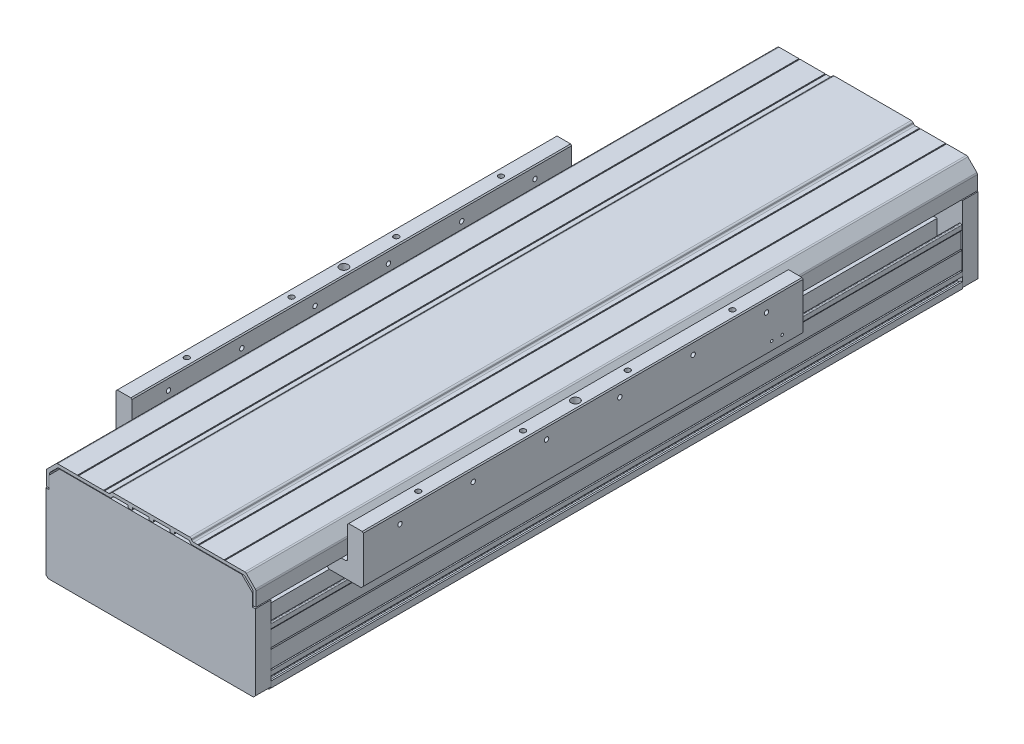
from build123d import *

# Parameters (mm, degrees)
EXTRUDE_1_DEPTH             = 330
EXTRUDE_2_DEPTH             = 15
EXTRUDE_3_DEPTH             = 15
EXTRUDE_4_DEPTH             = 420
EXTRUDE_5_DEPTH             = 344.5
HOLE_WIZARD_M8_1_AT_2_COUNT = 2
HOLE_WIZARD_M8_1_AT_2_PITCH = 173
PATTERN_LINEAR_1_COUNT      = 3
PATTERN_LINEAR_1_PITCH      = 240
HOLE_WIZARD_M6_1_AT_2_COUNT = 2
HOLE_WIZARD_M6_1_AT_2_PITCH = 100
HOLE_WIZARD_M6_1_AT_3_COUNT = 2
HOLE_WIZARD_M6_1_AT_3_PITCH = 200
HOLE_WIZARD_M6_1_AT_4_COUNT = 2
HOLE_WIZARD_M6_1_AT_4_PITCH = 300
HOLE_WIZARD_M5_1_AT_2_COUNT = 2
HOLE_WIZARD_M5_1_AT_2_PITCH = 70
HOLE_WIZARD_M5_1_AT_3_COUNT = 2
HOLE_WIZARD_M5_1_AT_3_PITCH = 210
HOLE_WIZARD_M5_1_AT_4_COUNT = 2
HOLE_WIZARD_M5_1_AT_4_PITCH = 350
HOLE_WIZARD_M5_1_AT_5_COUNT = 2
HOLE_WIZARD_M5_1_AT_5_PITCH = 280
HOLE_WIZARD_M5_1_AT_6_COUNT = 2
HOLE_WIZARD_M5_1_AT_6_PITCH = 140
SKETCH_13_R                 = 2.5
CUT_EXTRUDE_1_DEPTH         = 47
SKETCH_14_R                 = 4
CUT_EXTRUDE_2_DEPTH         = 18
HOLE_WIZARD_M3_1_AT_2_COUNT = 2
HOLE_WIZARD_M3_1_AT_2_PITCH = 10


with BuildPart() as part:
    # Sketch 1 → Extrude 1 (new, symmetric)
    # profile 1 of 3: a face of its own
    with BuildSketch(Plane.XY):
        with BuildLine():
            Line((-99, 33.5), (-99, 48.5))
            Line((-99, 48.5), (-99.5, 49.5))
            Line((-99.5, 49.5), (-99.5, 53.5))
            ThreePointArc((-99.5, 53.5), (-99.207106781, 54.207106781), (-98.5, 54.5))
            Line((-98.5, 54.5), (-98, 54.5))
            ThreePointArc((-98, 54.5), (-97.292893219, 54.207106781), (-97, 53.5))
            Line((-97, 53.5), (-97, 16.5))
            ThreePointArc((-97, 16.5), (-97.146446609, 16.146446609), (-97.5, 16))
            Line((-97.5, 16), (-99, 16))
            ThreePointArc((-99, 16), (-99.353553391, 16.146446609), (-99.5, 16.5))
            Line((-99.5, 16.5), (-99.5, 32.5))
            Line((-99.5, 32.5), (-99, 33.5))
        make_face()
    # profile 2 of 3: a face of its own
    with BuildSketch(Plane.XY):
        with BuildLine():
            Line((99, 33.5), (99, 48.5))
            Line((99, 48.5), (99.5, 49.5))
            Line((99.5, 49.5), (99.5, 53.5))
            ThreePointArc((99.5, 53.5), (99.207106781, 54.207106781), (98.5, 54.5))
            Line((98.5, 54.5), (98, 54.5))
            ThreePointArc((98, 54.5), (97.292893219, 54.207106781), (97, 53.5))
            Line((97, 53.5), (97, 16.5))
            ThreePointArc((97, 16.5), (97.146446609, 16.146446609), (97.5, 16))
            Line((97.5, 16), (99, 16))
            ThreePointArc((99, 16), (99.353553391, 16.146446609), (99.5, 16.5))
            Line((99.5, 16.5), (99.5, 32.5))
            Line((99.5, 32.5), (99, 33.5))
        make_face()
    # profile 3 of 3: a face of its own
    with BuildSketch(Plane.XY):
        with BuildLine():
            Line((-78, 44.5), (-43.5, 44.5))
            Line((-43.5, 44.5), (-43.5, 22.499959))
            ThreePointArc((-43.5, 22.499959), (-42.035533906, 18.964425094), (-38.5, 17.499959))
            Line((-38.5, 17.499959), (-38.5, 16.499959))
            Line((-38.5, 16.499959), (-22.9999959, 16.499959))
            Line((-22.9999959, 16.499959), (-22.5, 15.999959))
            Line((-22.5, 15.999959), (22.5, 15.999959))
            Line((22.5, 15.999959), (22.9999959, 16.499959))
            Line((22.9999959, 16.499959), (38.5, 16.499959))
            Line((38.5, 16.499959), (38.5, 17.499959))
            ThreePointArc((38.5, 17.499959), (42.035533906, 18.964425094), (43.5, 22.499959))
            Line((43.5, 22.499959), (43.5, 44.5))
            Line((43.5, 44.5), (71, 44.5))
            Line((71, 44.5), (71, 47.5))
            Line((71, 47.5), (76, 47.5))
            Line((76, 47.5), (76, 31.4999))
            Line((76, 31.4999), (76.3, 31.4999))
            Line((76.3, 31.4999), (76.3, 24.58099761))
            ThreePointArc((76.3, 24.58099761), (76.246719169, 24.583200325), (76.193631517, 24.588240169))
            ThreePointArc((76.193631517, 24.588240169), (74.617365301, 22.19481599), (77.476923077, 22.384615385))
            ThreePointArc((77.476923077, 22.384615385), (77.845299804, 22.832050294), (78.4, 23))
            Line((78.4, 23), (80.8, 23))
            Line((80.8, 23), (81, 22.8))
            Line((81, 22.8), (81, 21.2))
            Line((81, 21.2), (80.8, 21))
            Line((80.8, 21), (79.5, 21))
            Line((79.5, 21), (79.5, 18))
            Line((79.5, 18), (93.5, 18))
            Line((93.5, 18), (93.5, 21))
            Line((93.5, 21), (92.2, 21))
            Line((92.2, 21), (92, 21.2))
            Line((92, 21.2), (92, 22.8))
            Line((92, 22.8), (92.2, 23))
            Line((92.2, 23), (94, 23))
            ThreePointArc((94, 23), (94.707106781, 23.292893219), (95, 24))
            Line((95, 24), (95, 25.5))
            Line((95, 25.5), (97, 25.5))
            Line((97, 25.5), (97, 22.000000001))
            Line((97, 22.000000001), (96.7, 21.5))
            Line((96.7, 21.5), (97, 21))
            Line((97, 21), (97, 15.5))
            Line((97, 15.5), (100, 15.5))
            Line((100, 15.5), (99.999985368, 11.15))
            Line((99.999985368, 11.15), (98.499985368, 11.15))
            Line((98.499985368, 11.15), (98.499985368, 12.65))
            Line((98.499985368, 12.65), (95.499985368, 12.65))
            ThreePointArc((95.499985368, 12.65), (95.146431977, 12.503553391), (94.999985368, 12.15))
            Line((94.999985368, 12.15), (94.999985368, 5.85))
            ThreePointArc((94.999985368, 5.85), (95.146431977, 5.496446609), (95.499985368, 5.35))
            Line((95.499985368, 5.35), (98.499985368, 5.35))
            Line((98.499985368, 5.35), (98.499985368, 6.85))
            Line((98.499985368, 6.85), (99.999985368, 6.85))
            Line((99.999985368, 6.85), (100, 1))
            Line((100, 1), (98, -1))
            Line((98, -1), (36, -1))
            Line((36, -1), (35, 0))
            Line((35, 0), (-35, 0))
            Line((-35, 0), (-36, -1))
            Line((-36, -1), (-98, -1))
            Line((-98, -1), (-100, 1))
            Line((-100, 1), (-99.999985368, 6.85))
            Line((-99.999985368, 6.85), (-98.499985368, 6.85))
            Line((-98.499985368, 6.85), (-98.499985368, 5.35))
            Line((-98.499985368, 5.35), (-95.499985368, 5.35))
            ThreePointArc((-95.499985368, 5.35), (-95.146431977, 5.496446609), (-94.999985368, 5.85))
            Line((-94.999985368, 5.85), (-94.999985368, 12.15))
            ThreePointArc((-94.999985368, 12.15), (-95.146431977, 12.503553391), (-95.499985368, 12.65))
            Line((-95.499985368, 12.65), (-98.499985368, 12.65))
            Line((-98.499985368, 12.65), (-98.499985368, 11.15))
            Line((-98.499985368, 11.15), (-99.999985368, 11.15))
            Line((-99.999985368, 11.15), (-100, 15.5))
            Line((-100, 15.5), (-97, 15.5))
            Line((-97, 15.5), (-97, 21))
            Line((-97, 21), (-96.7, 21.5))
            Line((-96.7, 21.5), (-97, 22))
            Line((-97, 22), (-97, 25.5))
            Line((-97, 25.5), (-95, 25.5))
            Line((-95, 25.5), (-95, 24))
            ThreePointArc((-95, 24), (-94.707106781, 23.292893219), (-94, 23))
            Line((-94, 23), (-92.2, 23))
            Line((-92.2, 23), (-92, 22.8))
            Line((-92, 22.8), (-92, 21.2))
            Line((-92, 21.2), (-92.2, 21))
            Line((-92.2, 21), (-93.5, 21))
            Line((-93.5, 21), (-93.5, 18))
            Line((-93.5, 18), (-79.5, 18))
            Line((-79.5, 18), (-79.5, 21))
            Line((-79.5, 21), (-80.8, 21))
            Line((-80.8, 21), (-81, 21.2))
            Line((-81, 21.2), (-81, 22.8))
            Line((-81, 22.8), (-80.8, 23))
            Line((-80.8, 23), (-78.4, 23))
            ThreePointArc((-78.4, 23), (-77.845299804, 22.832050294), (-77.476923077, 22.384615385))
            ThreePointArc((-77.476923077, 22.384615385), (-74.617365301, 22.19481599), (-76.193631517, 24.588240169))
            ThreePointArc((-76.193631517, 24.588240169), (-76.76123201, 24.686146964), (-77.180676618, 25.080890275))
            Line((-77.180676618, 25.080890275), (-78, 26.5))
            Line((-78, 26.5), (-78, 36.5))
            Line((-78, 36.5), (-77.7, 37))
            Line((-77.7, 37), (-78, 37.5))
            Line((-78, 37.5), (-78, 44.5))
        make_face()
        with BuildLine():
            Line((-66.55, 32.5), (-54.5, 32.5))
            ThreePointArc((-54.5, 32.5), (-53.085786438, 31.914213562), (-52.5, 30.5))
            Line((-52.5, 30.5), (-52.5, 16.25))
            ThreePointArc((-52.5, 16.25), (-52.353553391, 15.896446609), (-52, 15.75))
            Line((-52, 15.75), (-51.407878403, 15.75))
            ThreePointArc((-51.407878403, 15.75), (-51.235654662, 15.780597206), (-51.084509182, 15.868644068))
            ThreePointArc((-51.084509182, 15.868644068), (-47.054594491, 13.850026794), (-51.300978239, 12.338983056))
            ThreePointArc((-51.300978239, 12.338983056), (-51.467890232, 12.457980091), (-51.668524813, 12.5))
            Line((-51.668524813, 12.5), (-67.5, 12.5))
            ThreePointArc((-67.5, 12.5), (-68.914213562, 13.085786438), (-69.5, 14.5))
            Line((-69.5, 14.5), (-69.5, 30.092681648))
            ThreePointArc((-69.5, 30.092681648), (-69.617656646, 30.414882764), (-69.915254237, 30.58544747))
            ThreePointArc((-69.915254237, 30.58544747), (-71.07878547, 34.873482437), (-67.05, 33))
            ThreePointArc((-67.05, 33), (-66.903553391, 32.646446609), (-66.55, 32.5))
        make_face(mode=Mode.SUBTRACT)
        with BuildLine():
            Line((-16.901923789, 9.5), (-14.303847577, 11))
            Line((-14.303847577, 11), (-7.333333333, 11))
            Line((-7.333333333, 11), (-4, 9))
            Line((-4, 9), (4, 9))
            Line((4, 9), (7.333333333, 11))
            Line((7.333333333, 11), (14.303847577, 11))
            Line((14.303847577, 11), (16.901923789, 9.5))
            Line((16.901923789, 9.5), (18.062862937, 9.5))
            ThreePointArc((18.062862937, 9.5), (22.45, 8), (18.062862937, 6.5))
            Line((18.062862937, 6.5), (16.901923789, 6.5))
            Line((16.901923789, 6.5), (14.303847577, 5))
            Line((14.303847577, 5), (-14.303847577, 5))
            Line((-14.303847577, 5), (-16.901923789, 6.5))
            Line((-16.901923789, 6.5), (-18.062862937, 6.5))
            ThreePointArc((-18.062862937, 6.5), (-22.45, 8), (-18.062862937, 9.5))
            Line((-18.062862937, 9.5), (-16.901923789, 9.5))
        make_face(mode=Mode.SUBTRACT)
        with BuildLine():
            Line((66.549999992, 32.500000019), (54.499999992, 32.500000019))
            ThreePointArc((54.499999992, 32.500000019), (53.085786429, 31.914213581), (52.499999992, 30.500000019))
            Line((52.499999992, 30.500000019), (52.499999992, 16.250000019))
            ThreePointArc((52.499999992, 16.250000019), (52.353553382, 15.896446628), (51.999999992, 15.750000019))
            Line((51.999999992, 15.750000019), (51.407878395, 15.750000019))
            ThreePointArc((51.407878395, 15.750000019), (51.235654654, 15.780597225), (51.084509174, 15.868644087))
            ThreePointArc((51.084509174, 15.868644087), (47.054594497, 13.850026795), (51.30097824, 12.338983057))
            ThreePointArc((51.30097824, 12.338983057), (51.467890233, 12.457980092), (51.668524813, 12.5))
            Line((51.668524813, 12.5), (67.5, 12.5))
            ThreePointArc((67.5, 12.5), (68.914213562, 13.085786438), (69.5, 14.5))
            Line((69.5, 14.5), (69.5, 30.092681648))
            ThreePointArc((69.5, 30.092681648), (69.617656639, 30.414882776), (69.915254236, 30.585447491))
            ThreePointArc((69.915254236, 30.585447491), (71.078785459, 34.873482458), (67.049999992, 33.000000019))
            ThreePointArc((67.049999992, 33.000000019), (66.903553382, 32.646446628), (66.549999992, 32.500000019))
        make_face(mode=Mode.SUBTRACT)
    extrude(amount=EXTRUDE_1_DEPTH, both=True)

    # Sketch 7 → Hole Wizard M8 _ _ _ _1 (revolve, cut)
    with BuildSketch(Plane(origin=(-86.5, 18, 240), x_dir=(0, 0, 1), z_dir=(1, 0, 0))):
        Polygon((0, 0), (0, 19), (4.5, 19), (4.5, 9), (7, 9), (7, 0), align=None)
    hole_wizard_m8_1 = revolve(axis=Axis((-86.5, 24.35, 240), (0, -1, 0)), mode=Mode.SUBTRACT)

    # Hole Wizard M8 _ _ _ _1 at 2: Hole Wizard M8 _ _ _ _1 ×2
    with Locations(*[(i * HOLE_WIZARD_M8_1_AT_2_PITCH, 0, 0) for i in range(1, HOLE_WIZARD_M8_1_AT_2_COUNT)]):
        add(hole_wizard_m8_1, mode=Mode.SUBTRACT)

    # Pattern Linear 1: Hole Wizard M8 _ _ _ _1 ×3
    with Locations(*[(0, 0, -i * PATTERN_LINEAR_1_PITCH) for i in range(1, PATTERN_LINEAR_1_COUNT)]):
        add(hole_wizard_m8_1, mode=Mode.SUBTRACT)

    # Pattern Linear 1 copy 1 sketch → Pattern Linear 1 copy 1 (revolve, cut)
    with BuildSketch(Plane(origin=(86.5, 18, 0), x_dir=(0, 0, 1), z_dir=(1, 0, 0))):
        Polygon((0, 0), (0, 19), (4.5, 19), (4.5, 9), (7, 9), (7, 0), align=None)
    revolve(axis=Axis((86.5, 24.35, 0), (0, -1, 0)), mode=Mode.SUBTRACT)

    # Pattern Linear 1 copy 2 sketch → Pattern Linear 1 copy 2 (revolve, cut)
    with BuildSketch(Plane(origin=(86.5, 18, -240), x_dir=(0, 0, 1), z_dir=(1, 0, 0))):
        Polygon((0, 0), (0, 19), (4.5, 19), (4.5, 9), (7, 9), (7, 0), align=None)
    revolve(axis=Axis((86.5, 24.35, -240), (0, -1, 0)), mode=Mode.SUBTRACT)


with BuildPart() as body_2:
    # Sketch 2 → Extrude 2 (new body)
    with BuildSketch(Plane.XY.offset(330)):
        Polygon((97.000014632, 86.000015), (87.000014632, 96.000015), (-86.999985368, 96.000015), (-96.999985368, 86.000015), (-96.999985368, 74), (-99.999985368, 74), (-99.999985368, 2), (-97.999985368, 0), (97.999985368, 0), (100.000014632, 2.000029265), (100.000014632, 74), (97.000014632, 74), align=None)
    extrude(amount=EXTRUDE_2_DEPTH)


with BuildPart() as body_3:
    # Sketch 3 → Extrude 3 (new body)
    with BuildSketch(Plane(origin=(0, 0, -330), x_dir=(-1, 0, 0), z_dir=(0, 0, -1))):
        Polygon((97.000014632, 86.000015), (87.000014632, 96.000015), (-86.999985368, 96.000015), (-96.999985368, 86.000015), (-96.999985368, 74), (-99.999985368, 74), (-99.999985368, 2), (-97.999985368, 0), (97.999985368, 0), (100.000014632, 2.000029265), (100.000014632, 74), (97.000014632, 74), align=None)
    extrude(amount=EXTRUDE_3_DEPTH)


with BuildPart() as body_4:
    # Sketch 4 → Extrude 4 (new body)
    with BuildSketch(Plane.XY.offset(260)):
        with BuildLine():
            ThreePointArc((-103, 74), (-102.414213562, 72.585786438), (-101, 72))
            Line((-101, 72), (-96, 72))
            ThreePointArc((-96, 72), (-94.585786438, 72.585786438), (-94, 74))
            Line((-94, 74), (-94, 77.5))
            ThreePointArc((-94, 77.5), (-91.071067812, 84.571067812), (-84, 87.5))
            Line((-84, 87.5), (-58.5, 87.5))
            Line((-58.5, 87.5), (-56.5, 89.5))
            Line((-56.5, 89.5), (56.5, 89.5))
            Line((56.5, 89.5), (58.5, 87.5))
            Line((58.5, 87.5), (84, 87.5))
            ThreePointArc((84, 87.5), (91.071067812, 84.571067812), (94, 77.5))
            Line((94, 77.5), (94, 74))
            ThreePointArc((94, 74), (94.585786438, 72.585786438), (96, 72))
            Line((96, 72), (101, 72))
            ThreePointArc((101, 72), (102.414213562, 72.585786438), (103, 74))
            Line((103, 74), (103, 103))
            Line((103, 103), (104, 104))
            Line((104, 104), (117, 104))
            Line((117, 104), (118, 103))
            Line((118, 103), (118, 59))
            Line((118, 59), (116, 57))
            Line((116, 57), (85, 57))
            Line((85, 57), (83, 59))
            Line((83, 59), (83, 72.5))
            Line((83, 72.5), (-83, 72.5))
            Line((-83, 72.5), (-83, 59))
            Line((-83, 59), (-85, 57))
            Line((-85, 57), (-116, 57))
            Line((-116, 57), (-118, 59))
            Line((-118, 59), (-118, 103))
            Line((-118, 103), (-117, 104))
            Line((-117, 104), (-104, 104))
            Line((-104, 104), (-103, 103))
            Line((-103, 103), (-103, 74))
        make_face()
    extrude(amount=-EXTRUDE_4_DEPTH)

    # Sketch 9 → Hole Wizard M6 _ _1 (revolve, cut)
    with BuildSketch(Plane(origin=(110.5, 104, 200), x_dir=(0, 0, 1), z_dir=(1, 0, 0))):
        Polygon((0, 0), (0, 24.502151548), (2.5, 23), (2.5, 0), align=None)
    hole_wizard_m6_1 = revolve(axis=Axis((110.5, 110.35, 200), (0, -1, 0)), mode=Mode.SUBTRACT)

    # Hole Wizard M6 _ _1 at 2: Hole Wizard M6 _ _1 ×2
    with Locations(*[(0, 0, -i * HOLE_WIZARD_M6_1_AT_2_PITCH) for i in range(1, HOLE_WIZARD_M6_1_AT_2_COUNT)]):
        add(hole_wizard_m6_1, mode=Mode.SUBTRACT)

    # Hole Wizard M6 _ _1 at 3: Hole Wizard M6 _ _1 ×2
    with Locations(*[(0, 0, -i * HOLE_WIZARD_M6_1_AT_3_PITCH) for i in range(1, HOLE_WIZARD_M6_1_AT_3_COUNT)]):
        add(hole_wizard_m6_1, mode=Mode.SUBTRACT)

    # Hole Wizard M6 _ _1 at 4: Hole Wizard M6 _ _1 ×2
    with Locations(*[(0, 0, -i * HOLE_WIZARD_M6_1_AT_4_PITCH) for i in range(1, HOLE_WIZARD_M6_1_AT_4_COUNT)]):
        add(hole_wizard_m6_1, mode=Mode.SUBTRACT)

    # Sketch 11 → Hole Wizard M5 _ _1 (revolve, cut)
    with BuildSketch(Plane(origin=(118, 93, 225), x_dir=(0, 0, -1), z_dir=(0, 1, 0))):
        Polygon((0, 0), (0, 17.2618073), (2.1, 16), (2.1, 0), align=None)
    hole_wizard_m5_1 = revolve(axis=Axis((124.35, 93, 225), (-1, 0, 0)), mode=Mode.SUBTRACT)

    # Hole Wizard M5 _ _1 at 2: Hole Wizard M5 _ _1 ×2
    with Locations(*[(0, 0, -i * HOLE_WIZARD_M5_1_AT_2_PITCH) for i in range(1, HOLE_WIZARD_M5_1_AT_2_COUNT)]):
        add(hole_wizard_m5_1, mode=Mode.SUBTRACT)

    # Hole Wizard M5 _ _1 at 3: Hole Wizard M5 _ _1 ×2
    with Locations(*[(0, 0, -i * HOLE_WIZARD_M5_1_AT_3_PITCH) for i in range(1, HOLE_WIZARD_M5_1_AT_3_COUNT)]):
        add(hole_wizard_m5_1, mode=Mode.SUBTRACT)

    # Hole Wizard M5 _ _1 at 4: Hole Wizard M5 _ _1 ×2
    with Locations(*[(0, 0, -i * HOLE_WIZARD_M5_1_AT_4_PITCH) for i in range(1, HOLE_WIZARD_M5_1_AT_4_COUNT)]):
        add(hole_wizard_m5_1, mode=Mode.SUBTRACT)

    # Hole Wizard M5 _ _1 at 5: Hole Wizard M5 _ _1 ×2
    with Locations(*[(0, 0, -i * HOLE_WIZARD_M5_1_AT_5_PITCH) for i in range(1, HOLE_WIZARD_M5_1_AT_5_COUNT)]):
        add(hole_wizard_m5_1, mode=Mode.SUBTRACT)

    # Hole Wizard M5 _ _1 at 6: Hole Wizard M5 _ _1 ×2
    with Locations(*[(0, 0, -i * HOLE_WIZARD_M5_1_AT_6_PITCH) for i in range(1, HOLE_WIZARD_M5_1_AT_6_COUNT)]):
        add(hole_wizard_m5_1, mode=Mode.SUBTRACT)

    # Sketch 13 → Cut-Extrude 1 (cut)
    with BuildSketch(Plane(origin=(0, 104, 0), x_dir=(1, 0, 0), z_dir=(0, 1, 0))):
        with Locations(Location((110.5, -50, 0), (0, 0, 270))):
            Circle(SKETCH_13_R)
    cut_extrude_1 = extrude(amount=-CUT_EXTRUDE_1_DEPTH, mode=Mode.SUBTRACT)

    # Sketch 14 → Cut-Extrude 2 (cut)
    with BuildSketch(Plane(origin=(0, 104, 0), x_dir=(1, 0, 0), z_dir=(0, 1, 0))):
        with Locations(Location((110.5, -50, 0), (0, 0, 270))):
            Circle(SKETCH_14_R)
    cut_extrude_2 = extrude(amount=-CUT_EXTRUDE_2_DEPTH, mode=Mode.SUBTRACT)

    # Mirror 1: Hole Wizard M6 _ _1, Hole Wizard M5 _ _1, Cut-Extrude 1, Cut-Extrude 2 across plane
    add(hole_wizard_m6_1.mirror(Plane(origin=(0, 0, 0), x_dir=(0, 0, 1), z_dir=(1, 0, 0))), mode=Mode.SUBTRACT)
    add(hole_wizard_m5_1.mirror(Plane(origin=(0, 0, 0), x_dir=(0, 0, 1), z_dir=(1, 0, 0))), mode=Mode.SUBTRACT)
    add(cut_extrude_1.mirror(Plane(origin=(0, 0, 0), x_dir=(0, 0, 1), z_dir=(1, 0, 0))), mode=Mode.SUBTRACT)
    add(cut_extrude_2.mirror(Plane(origin=(0, 0, 0), x_dir=(0, 0, 1), z_dir=(1, 0, 0))), mode=Mode.SUBTRACT)

    # Mirror 1 copy 1 sketch → Mirror 1 copy 1 (revolve, cut)
    with BuildSketch(Plane(origin=(-110.5, 104, 100), x_dir=(0, 0, 1), z_dir=(-1, 0, 0))):
        Polygon((0, 0), (0, -24.502151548), (2.5, -23), (2.5, 0), align=None)
    revolve(axis=Axis((-110.5, 110.35, 100), (0, 1, 0)), mode=Mode.SUBTRACT)

    # Mirror 1 copy 2 sketch → Mirror 1 copy 2 (revolve, cut)
    with BuildSketch(Plane(origin=(-110.5, 104, 0), x_dir=(0, 0, 1), z_dir=(-1, 0, 0))):
        Polygon((0, 0), (0, -24.502151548), (2.5, -23), (2.5, 0), align=None)
    revolve(axis=Axis((-110.5, 110.35, 0), (0, 1, 0)), mode=Mode.SUBTRACT)

    # Mirror 1 copy 3 sketch → Mirror 1 copy 3 (revolve, cut)
    with BuildSketch(Plane(origin=(-110.5, 104, -100), x_dir=(0, 0, 1), z_dir=(-1, 0, 0))):
        Polygon((0, 0), (0, -24.502151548), (2.5, -23), (2.5, 0), align=None)
    revolve(axis=Axis((-110.5, 110.35, -100), (0, 1, 0)), mode=Mode.SUBTRACT)

    # Mirror 1 copy 4 sketch → Mirror 1 copy 4 (revolve, cut)
    with BuildSketch(Plane(origin=(-118, 93, 155), x_dir=(0, 0, -1), z_dir=(0, 1, 0))):
        Polygon((0, 0), (0, -17.2618073), (2.1, -16), (2.1, 0), align=None)
    revolve(axis=Axis((-124.35, 93, 155), (-1, 0, 0)), mode=Mode.SUBTRACT)

    # Mirror 1 copy 5 sketch → Mirror 1 copy 5 (revolve, cut)
    with BuildSketch(Plane(origin=(-118, 93, 15), x_dir=(0, 0, -1), z_dir=(0, 1, 0))):
        Polygon((0, 0), (0, -17.2618073), (2.1, -16), (2.1, 0), align=None)
    revolve(axis=Axis((-124.35, 93, 15), (-1, 0, 0)), mode=Mode.SUBTRACT)

    # Mirror 1 copy 6 sketch → Mirror 1 copy 6 (revolve, cut)
    with BuildSketch(Plane(origin=(-118, 93, -125), x_dir=(0, 0, -1), z_dir=(0, 1, 0))):
        Polygon((0, 0), (0, -17.2618073), (2.1, -16), (2.1, 0), align=None)
    revolve(axis=Axis((-124.35, 93, -125), (-1, 0, 0)), mode=Mode.SUBTRACT)

    # Mirror 1 copy 7 sketch → Mirror 1 copy 7 (revolve, cut)
    with BuildSketch(Plane(origin=(-118, 93, -55), x_dir=(0, 0, -1), z_dir=(0, 1, 0))):
        Polygon((0, 0), (0, -17.2618073), (2.1, -16), (2.1, 0), align=None)
    revolve(axis=Axis((-124.35, 93, -55), (-1, 0, 0)), mode=Mode.SUBTRACT)

    # Mirror 1 copy 8 sketch → Mirror 1 copy 8 (revolve, cut)
    with BuildSketch(Plane(origin=(-118, 93, 85), x_dir=(0, 0, -1), z_dir=(0, 1, 0))):
        Polygon((0, 0), (0, -17.2618073), (2.1, -16), (2.1, 0), align=None)
    revolve(axis=Axis((-124.35, 93, 85), (-1, 0, 0)), mode=Mode.SUBTRACT)

    # Sketch 15 → Hole Wizard M3 _ _1 (revolve, cut)
    with BuildSketch(Plane(origin=(118, 67, -140), x_dir=(0, 0, -1), z_dir=(0, 1, 0))):
        Polygon((0, 0), (0, 13.251075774), (1.25, 12.5), (1.25, 0), align=None)
    hole_wizard_m3_1 = revolve(axis=Axis((124.35, 67, -140), (-1, 0, 0)), mode=Mode.SUBTRACT)

    # Hole Wizard M3 _ _1 at 2: Hole Wizard M3 _ _1 ×2
    with Locations(*[(0, 0, i * HOLE_WIZARD_M3_1_AT_2_PITCH) for i in range(1, HOLE_WIZARD_M3_1_AT_2_COUNT)]):
        add(hole_wizard_m3_1, mode=Mode.SUBTRACT)

    # Mirror 2: Hole Wizard M3 _ _1 across plane
    add(hole_wizard_m3_1.mirror(Plane(origin=(0, 0, 0), x_dir=(0, 0, 1), z_dir=(1, 0, 0))), mode=Mode.SUBTRACT)

    # Mirror 2 copy 1 sketch → Mirror 2 copy 1 (revolve, cut)
    with BuildSketch(Plane(origin=(-118, 67, -130), x_dir=(0, 0, -1), z_dir=(0, 1, 0))):
        Polygon((0, 0), (0, -13.251075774), (1.25, -12.5), (1.25, 0), align=None)
    revolve(axis=Axis((-124.35, 67, -130), (-1, 0, 0)), mode=Mode.SUBTRACT)


with BuildPart() as body_5:
    # Sketch 5 → Extrude 5 (new, symmetric)
    with BuildSketch(Plane.XY):
        with BuildLine():
            Line((36.749407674, 101.5), (-36.749407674, 101.5))
            ThreePointArc((-36.749407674, 101.5), (-37.719816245, 101.248801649), (-38.446459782, 100.558307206))
            Line((-38.446459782, 100.558307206), (-38.830989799, 99.941692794))
            ThreePointArc((-38.830989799, 99.941692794), (-39.557633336, 99.251198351), (-40.528041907, 99))
            Line((-40.528041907, 99), (-44.5, 99))
            Line((-44.5, 99), (-45, 98.7))
            Line((-45, 98.7), (-45.5, 99))
            Line((-45.5, 99), (-69.5, 99))
            Line((-69.5, 99), (-70, 98.7))
            Line((-70, 98.7), (-70.5, 99))
            Line((-70.5, 99), (-89.369129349, 99))
            ThreePointArc((-89.369129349, 99), (-90.134496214, 98.847759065), (-90.783342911, 98.414213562))
            Line((-90.783342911, 98.414213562), (-99.414213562, 89.783342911))
            ThreePointArc((-99.414213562, 89.783342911), (-99.847759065, 89.134496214), (-100, 88.369129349))
            Line((-100, 88.369129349), (-100, 75))
            Line((-100, 75), (-97, 75))
            Line((-97, 75), (-97, 87.126488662))
            ThreePointArc((-97, 87.126488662), (-96.847759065, 87.891855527), (-96.414213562, 88.540702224))
            Line((-96.414213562, 88.540702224), (-89.540702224, 95.414213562))
            ThreePointArc((-89.540702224, 95.414213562), (-88.891855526, 95.847759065), (-88.126488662, 96))
            Line((-88.126488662, 96), (-39.21505842, 96))
            ThreePointArc((-39.21505842, 96), (-38.244649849, 96.251198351), (-37.518006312, 96.941692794))
            Line((-37.518006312, 96.941692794), (-37.133476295, 97.558307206))
            ThreePointArc((-37.133476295, 97.558307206), (-36.406832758, 98.248801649), (-35.436424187, 98.5))
            Line((-35.436424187, 98.5), (-22.25, 98.5))
            ThreePointArc((-22.25, 98.5), (-22.073223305, 98.426776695), (-22, 98.25))
            Line((-22, 98.25), (-22, 96.75))
            ThreePointArc((-22, 96.75), (-21.780330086, 96.219669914), (-21.25, 96))
            Line((-21.25, 96), (-18.75, 96))
            ThreePointArc((-18.75, 96), (-18.219669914, 96.219669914), (-18, 96.75))
            Line((-18, 96.75), (-18, 98.25))
            ThreePointArc((-18, 98.25), (-17.926776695, 98.426776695), (-17.75, 98.5))
            Line((-17.75, 98.5), (-2.25, 98.5))
            ThreePointArc((-2.25, 98.5), (-2.073223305, 98.426776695), (-2, 98.25))
            Line((-2, 98.25), (-2, 96.75))
            ThreePointArc((-2, 96.75), (-1.780330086, 96.219669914), (-1.25, 96))
            Line((-1.25, 96), (1.25, 96))
            ThreePointArc((1.25, 96), (1.780330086, 96.219669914), (2, 96.75))
            Line((2, 96.75), (2, 98.25))
            ThreePointArc((2, 98.25), (2.073223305, 98.426776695), (2.25, 98.5))
            Line((2.25, 98.5), (17.75, 98.5))
            ThreePointArc((17.75, 98.5), (17.926776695, 98.426776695), (18, 98.25))
            Line((18, 98.25), (18, 96.75))
            ThreePointArc((18, 96.75), (18.219669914, 96.219669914), (18.75, 96))
            Line((18.75, 96), (21.25, 96))
            ThreePointArc((21.25, 96), (21.780330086, 96.219669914), (22, 96.75))
            Line((22, 96.75), (22, 98.25))
            ThreePointArc((22, 98.25), (22.073223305, 98.426776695), (22.25, 98.5))
            Line((22.25, 98.5), (35.436424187, 98.5))
            ThreePointArc((35.436424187, 98.5), (36.406832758, 98.248801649), (37.133476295, 97.558307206))
            Line((37.133476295, 97.558307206), (37.518006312, 96.941692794))
            ThreePointArc((37.518006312, 96.941692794), (38.244649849, 96.251198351), (39.21505842, 96))
            Line((39.21505842, 96), (88.126488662, 96))
            ThreePointArc((88.126488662, 96), (88.891855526, 95.847759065), (89.540702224, 95.414213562))
            Line((89.540702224, 95.414213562), (96.414213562, 88.540702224))
            ThreePointArc((96.414213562, 88.540702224), (96.847759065, 87.891855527), (97, 87.126488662))
            Line((97, 87.126488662), (97, 75))
            Line((97, 75), (100, 75))
            Line((100, 75), (100, 88.369129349))
            ThreePointArc((100, 88.369129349), (99.847759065, 89.134496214), (99.414213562, 89.783342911))
            Line((99.414213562, 89.783342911), (90.783342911, 98.414213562))
            ThreePointArc((90.783342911, 98.414213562), (90.134496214, 98.847759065), (89.369129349, 99))
            Line((89.369129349, 99), (70.5, 99))
            Line((70.5, 99), (70, 98.7))
            Line((70, 98.7), (69.5, 99))
            Line((69.5, 99), (45.5, 99))
            Line((45.5, 99), (45, 98.7))
            Line((45, 98.7), (44.5, 99))
            Line((44.5, 99), (40.528041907, 99))
            ThreePointArc((40.528041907, 99), (39.557633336, 99.251198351), (38.830989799, 99.941692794))
            Line((38.830989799, 99.941692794), (38.446459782, 100.558307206))
            ThreePointArc((38.446459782, 100.558307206), (37.719816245, 101.248801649), (36.749407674, 101.5))
        make_face()
    extrude(amount=EXTRUDE_5_DEPTH, both=True)


solid = Compound([part.part, body_2.part, body_3.part, body_4.part, body_5.part])
